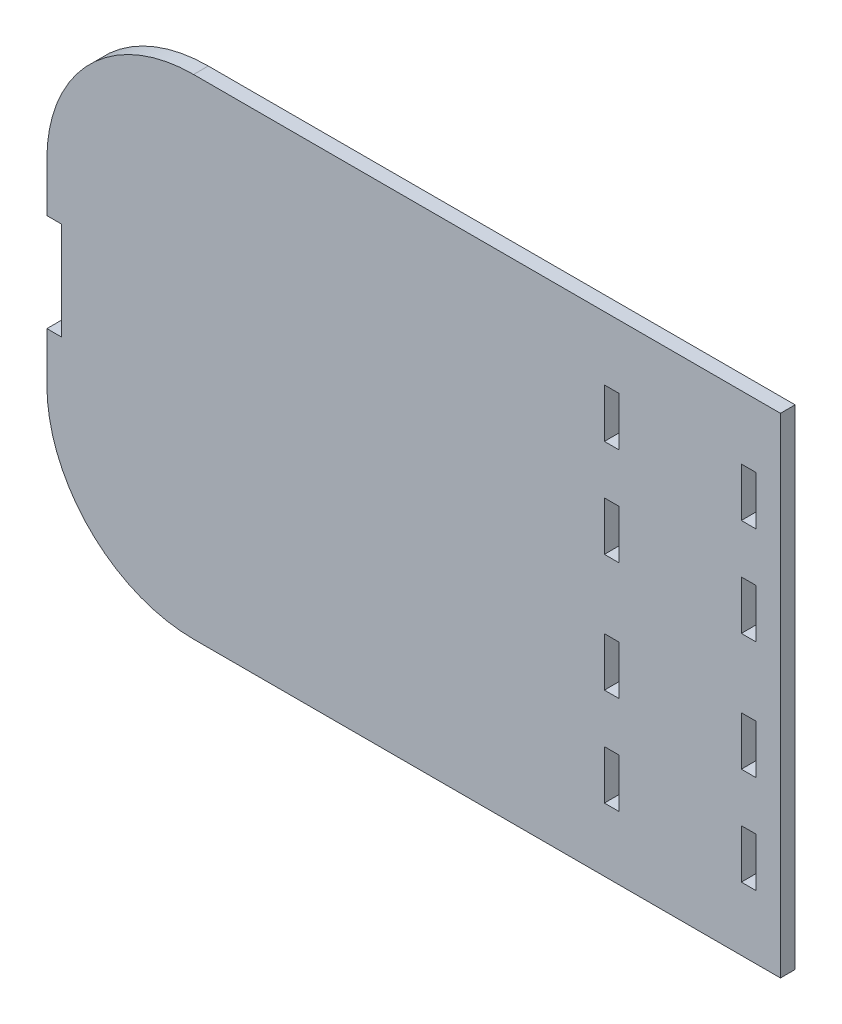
from build123d import *

# Parameters (mm, degrees)
SKETCH1_W           = 3
SKETCH1_H           = 10
BOSS_EXTRUDE1_DEPTH = 3


with BuildPart() as part:
    # Sketch1 → Boss-Extrude1 (new body)
    with BuildSketch(Plane.XY):
        with BuildLine():
            Line((75, -50), (-45, -50))
            ThreePointArc((-45, -50), (-66.213203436, -41.213203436), (-75, -20))
            Line((-75, -20), (-75, -10))
            Line((-75, -10), (-72, -10))
            Line((-72, -10), (-72, 10))
            Line((-72, 10), (-75, 10))
            Line((-75, 10), (-75, 20))
            ThreePointArc((-75, 20), (-66.213203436, 41.213203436), (-45, 50))
            Line((-45, 50), (75, 50))
            Line((75, 50), (75, -50))
        make_face()
        with Locations((68.5, 32.02)):
            Rectangle(SKETCH1_W, SKETCH1_H, mode=Mode.SUBTRACT)
        with Locations((68.5, -32.02)):
            Rectangle(SKETCH1_W, SKETCH1_H, mode=Mode.SUBTRACT)
        with Locations((68.5, 12.02)):
            Rectangle(SKETCH1_W, SKETCH1_H, mode=Mode.SUBTRACT)
        with Locations((68.5, -12.02)):
            Rectangle(SKETCH1_W, SKETCH1_H, mode=Mode.SUBTRACT)
        with Locations((40.5, 32.02)):
            Rectangle(SKETCH1_W, SKETCH1_H, mode=Mode.SUBTRACT)
        with Locations((40.5, 12.02)):
            Rectangle(SKETCH1_W, SKETCH1_H, mode=Mode.SUBTRACT)
        with Locations((40.5, -12.02)):
            Rectangle(SKETCH1_W, SKETCH1_H, mode=Mode.SUBTRACT)
        with Locations((40.5, -32.02)):
            Rectangle(SKETCH1_W, SKETCH1_H, mode=Mode.SUBTRACT)
    extrude(amount=BOSS_EXTRUDE1_DEPTH)


solid = part.part
